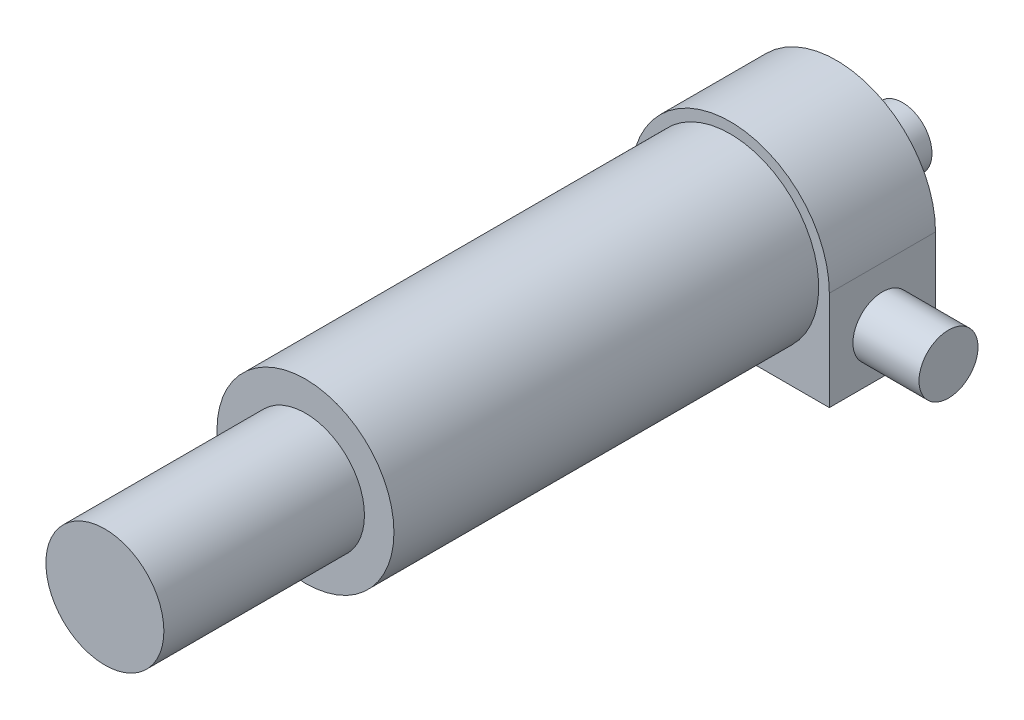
from build123d import *

# Parameters (mm, degrees)
SKETCH1_R          = 19.05
TI_TUBE_DEPTH      = 91.44
PUMP_HOUSING_DEPTH = 22.86
SKETCH3_R          = 6.35
HOSE_BARB1_DEPTH   = 14.224
SKETCH4_R          = 6.35
HOSE_BARB2_DEPTH   = 14.224
SKETCH5_R          = 12.7
UW_CONN_DEPTH      = 43.18


with BuildPart() as part:
    # Sketch1 → Ti_tube (new body)
    with BuildSketch(Plane.XY):
        Circle(SKETCH1_R)
    extrude(amount=TI_TUBE_DEPTH)

    # Sketch2 → pump_housing (add)
    with BuildSketch(Plane(origin=(0, 0, 0), x_dir=(-1, 0, 0), z_dir=(0, 0, -1))):
        with BuildLine():
            Line((-21.336, 0), (-21.336, -21.336))
            Line((-21.336, -21.336), (0, -21.336))
            ThreePointArc((0, -21.336), (21.336, 0), (0, 21.336))
            ThreePointArc((0, 21.336), (-15.086830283, 15.086830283), (-21.336, 0))
        make_face()
    extrude(amount=PUMP_HOUSING_DEPTH)

    # Sketch3 → hose_barb1 (add)
    with BuildSketch(Plane(origin=(21.336, 0, 0), x_dir=(0, 0, -1), z_dir=(1, 0, 0))):
        with Locations(Location((11.43, -11.811, 0), (0, 0, 270))):
            Circle(SKETCH3_R)
    extrude(amount=HOSE_BARB1_DEPTH)

    # Sketch4 → hose_barb2 (add)
    with BuildSketch(Plane(origin=(0, 0, -22.86), x_dir=(-1, 0, 0), z_dir=(0, 0, -1))):
        Circle(SKETCH4_R)
    extrude(amount=HOSE_BARB2_DEPTH)

    # Sketch5 → uw_conn (add)
    with BuildSketch(Plane.XY.offset(91.44)):
        Circle(SKETCH5_R)
    extrude(amount=UW_CONN_DEPTH)


solid = part.part
